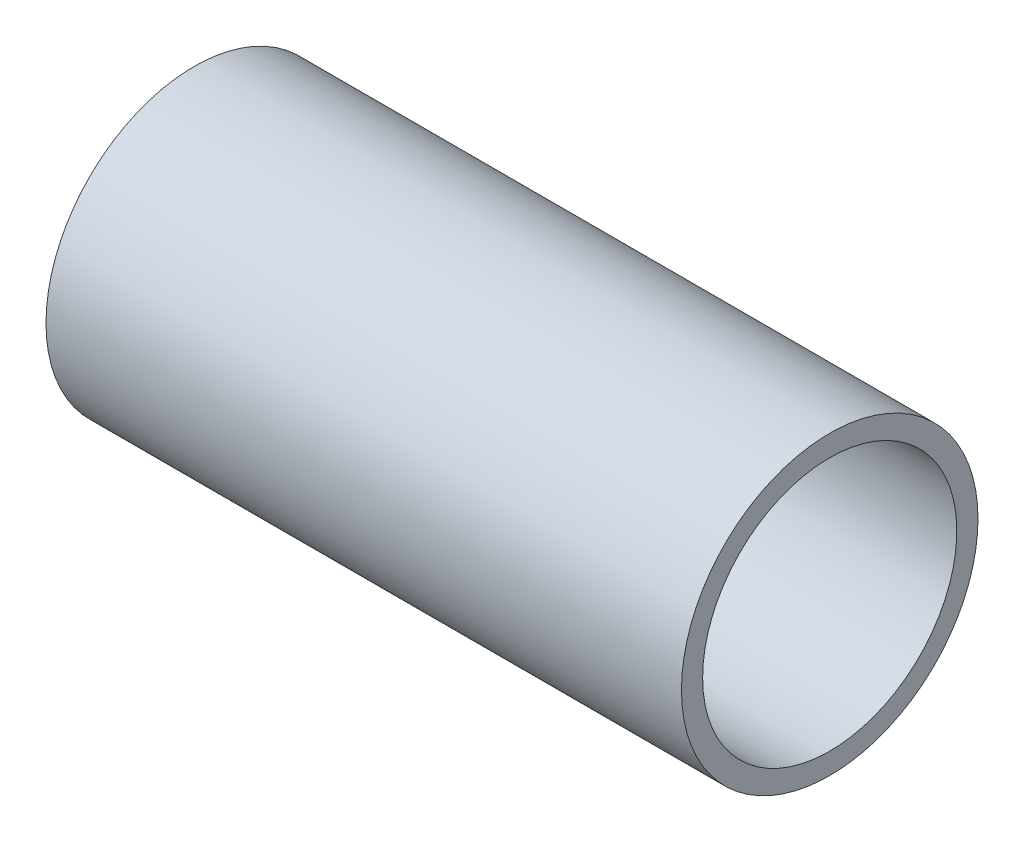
from build123d import *

# Parameters (mm, degrees)
ESQUISSE2_R      = 7
ESQUISSE2_R_2    = 6
EXTRUSION1_DEPTH = 30


with BuildPart() as part:
    # Esquisse2 → Extrusion1 (new body)
    with BuildSketch(Plane.ZY.offset(15)):
        with Locations((2, 380)):
            Circle(ESQUISSE2_R)
        with Locations((2, 380)):
            Circle(ESQUISSE2_R_2, mode=Mode.SUBTRACT)
    extrude(amount=-EXTRUSION1_DEPTH)


solid = part.part
